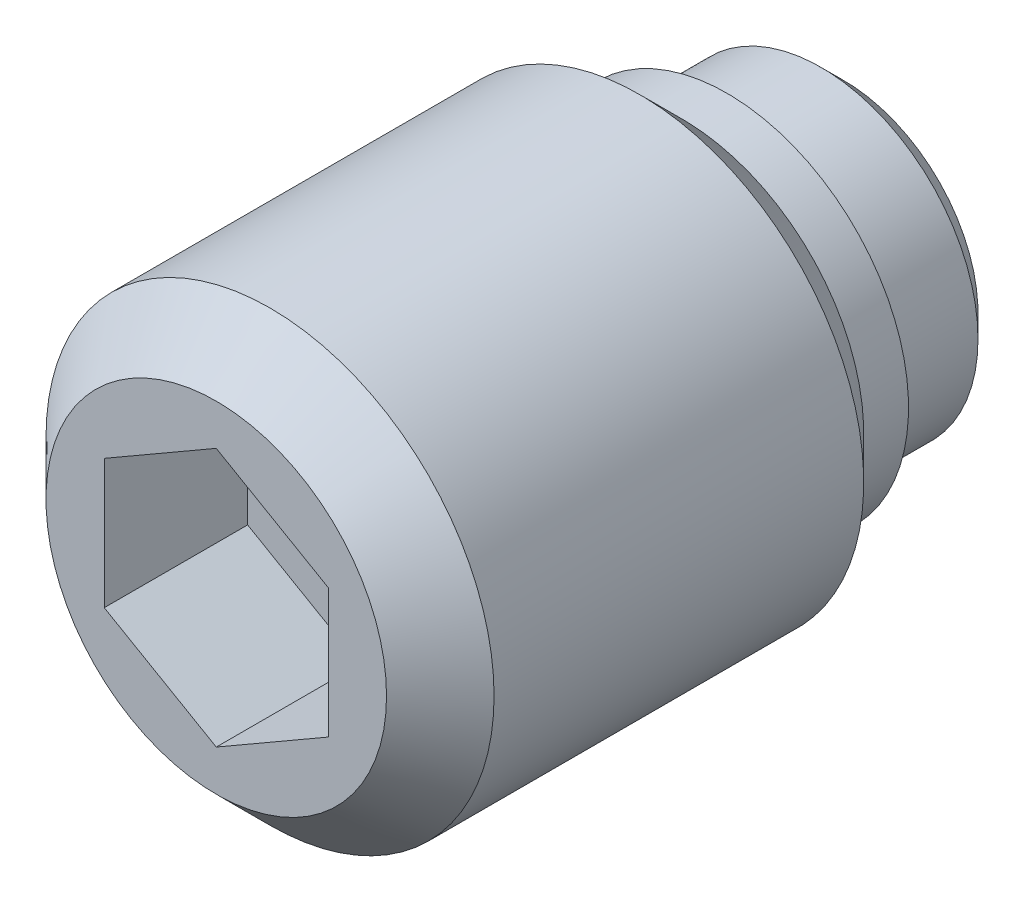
ISO-10303-21;
HEADER;
FILE_DESCRIPTION(('STEP AP214'),'2;1');
FILE_NAME('part.step','',(''),(''),'','','');
FILE_SCHEMA(('AUTOMOTIVE_DESIGN { 1 0 10303 214 1 1 1 1 }'));
ENDSEC;
DATA;
#1=APPLICATION_CONTEXT('core data for automotive mechanical design processes');
#2=APPLICATION_PROTOCOL_DEFINITION('international standard','automotive_design',2000,#1);
#3=PRODUCT_CONTEXT('',#1,'mechanical');
#4=PRODUCT('Part','Part','',(#3));
#5=PRODUCT_RELATED_PRODUCT_CATEGORY('part','',(#4));
#6=PRODUCT_DEFINITION_FORMATION('','',#4);
#7=PRODUCT_DEFINITION_CONTEXT('part definition',#1,'design');
#8=PRODUCT_DEFINITION('design','',#6,#7);
#9=PRODUCT_DEFINITION_SHAPE('','',#8);
#10=(LENGTH_UNIT() NAMED_UNIT(*) SI_UNIT(.MILLI.,.METRE.));
#11=(NAMED_UNIT(*) PLANE_ANGLE_UNIT() SI_UNIT($,.RADIAN.));
#12=(NAMED_UNIT(*) SI_UNIT($,.STERADIAN.) SOLID_ANGLE_UNIT());
#13=UNCERTAINTY_MEASURE_WITH_UNIT(LENGTH_MEASURE(1.E-05),#10,'distance_accuracy_value','');
#14=(GEOMETRIC_REPRESENTATION_CONTEXT(3) GLOBAL_UNCERTAINTY_ASSIGNED_CONTEXT((#13)) GLOBAL_UNIT_ASSIGNED_CONTEXT((#10,
#11,#12)) REPRESENTATION_CONTEXT('',''));
#15=CARTESIAN_POINT('',(0.,0.,0.));
#16=DIRECTION('',(0.,0.,1.));
#17=DIRECTION('',(1.,0.,0.));
#18=AXIS2_PLACEMENT_3D('',#15,#16,#17);
#19=CARTESIAN_POINT('',(0.,0.,2.6));
#20=DIRECTION('',(0.,0.,-1.));
#21=DIRECTION('',(-1.,0.,0.));
#22=AXIS2_PLACEMENT_3D('',#19,#20,#21);
#23=CYLINDRICAL_SURFACE('',#22,5.);
#24=CARTESIAN_POINT('',(0.,0.,4.55));
#25=DIRECTION('',(0.,0.,-1.));
#26=DIRECTION('',(-1.,0.,0.));
#27=AXIS2_PLACEMENT_3D('',#24,#25,#26);
#28=CIRCLE('',#27,5.);
#29=CARTESIAN_POINT('',(-5.,0.,4.55));
#30=VERTEX_POINT('',#29);
#31=EDGE_CURVE('E9',#30,#30,#28,.T.);
#32=ORIENTED_EDGE('',*,*,#31,.F.);
#33=EDGE_LOOP('',(#32));
#34=FACE_BOUND('',#33,.T.);
#35=CARTESIAN_POINT('',(0.,0.,12.8));
#36=DIRECTION('',(0.,0.,1.));
#37=DIRECTION('',(1.,0.,0.));
#38=AXIS2_PLACEMENT_3D('',#35,#36,#37);
#39=CIRCLE('',#38,5.);
#40=CARTESIAN_POINT('',(5.,0.,12.8));
#41=VERTEX_POINT('',#40);
#42=EDGE_CURVE('E123',#41,#41,#39,.T.);
#43=ORIENTED_EDGE('',*,*,#42,.F.);
#44=EDGE_LOOP('',(#43));
#45=FACE_BOUND('',#44,.T.);
#46=ADVANCED_FACE('F14',(#34,#45),#23,.T.);
#47=CARTESIAN_POINT('',(0.,0.,4.55));
#48=DIRECTION('',(0.,0.,1.));
#49=DIRECTION('',(1.,0.,0.));
#50=AXIS2_PLACEMENT_3D('',#47,#48,#49);
#51=CONICAL_SURFACE('',#50,5.,0.785398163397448);
#52=ORIENTED_EDGE('',*,*,#31,.T.);
#53=EDGE_LOOP('',(#52));
#54=FACE_BOUND('',#53,.T.);
#55=CARTESIAN_POINT('',(0.,0.,3.6));
#56=DIRECTION('',(0.,0.,-1.));
#57=DIRECTION('',(-1.,0.,0.));
#58=AXIS2_PLACEMENT_3D('',#55,#56,#57);
#59=CIRCLE('',#58,4.05);
#60=CARTESIAN_POINT('',(-4.05,0.,3.6));
#61=VERTEX_POINT('',#60);
#62=EDGE_CURVE('E21',#61,#61,#59,.T.);
#63=ORIENTED_EDGE('',*,*,#62,.F.);
#64=EDGE_LOOP('',(#63));
#65=FACE_BOUND('',#64,.T.);
#66=ADVANCED_FACE('F143',(#54,#65),#51,.T.);
#67=CARTESIAN_POINT('',(0.,0.,2.6));
#68=DIRECTION('',(0.,0.,-1.));
#69=DIRECTION('',(-1.,0.,0.));
#70=AXIS2_PLACEMENT_3D('',#67,#68,#69);
#71=CYLINDRICAL_SURFACE('',#70,4.05);
#72=ORIENTED_EDGE('',*,*,#62,.T.);
#73=EDGE_LOOP('',(#72));
#74=FACE_BOUND('',#73,.T.);
#75=CARTESIAN_POINT('',(0.,0.,2.6));
#76=DIRECTION('',(0.,0.,-1.));
#77=DIRECTION('',(-1.,0.,0.));
#78=AXIS2_PLACEMENT_3D('',#75,#76,#77);
#79=CIRCLE('',#78,4.05);
#80=CARTESIAN_POINT('',(-4.05,0.,2.6));
#81=VERTEX_POINT('',#80);
#82=EDGE_CURVE('E135',#81,#81,#79,.T.);
#83=ORIENTED_EDGE('',*,*,#82,.F.);
#84=EDGE_LOOP('',(#83));
#85=FACE_BOUND('',#84,.T.);
#86=ADVANCED_FACE('F140',(#74,#85),#71,.T.);
#87=CARTESIAN_POINT('',(0.,4.05,2.6));
#88=DIRECTION('',(0.,0.,1.));
#89=DIRECTION('',(1.,0.,0.));
#90=AXIS2_PLACEMENT_3D('',#87,#88,#89);
#91=PLANE('',#90);
#92=ORIENTED_EDGE('',*,*,#82,.T.);
#93=EDGE_LOOP('',(#92));
#94=FACE_BOUND('',#93,.T.);
#95=CARTESIAN_POINT('',(0.,0.,2.6));
#96=DIRECTION('',(0.,0.,-1.));
#97=DIRECTION('',(-1.,0.,0.));
#98=AXIS2_PLACEMENT_3D('',#95,#96,#97);
#99=CIRCLE('',#98,3.5);
#100=CARTESIAN_POINT('',(-3.5,0.,2.6));
#101=VERTEX_POINT('',#100);
#102=EDGE_CURVE('E132',#101,#101,#99,.T.);
#103=ORIENTED_EDGE('',*,*,#102,.F.);
#104=EDGE_LOOP('',(#103));
#105=FACE_BOUND('',#104,.T.);
#106=ADVANCED_FACE('F151',(#94,#105),#91,.F.);
#107=CARTESIAN_POINT('',(0.,0.,0.));
#108=DIRECTION('',(0.,0.,-1.));
#109=DIRECTION('',(-1.,0.,0.));
#110=AXIS2_PLACEMENT_3D('',#107,#108,#109);
#111=CYLINDRICAL_SURFACE('',#110,3.5);
#112=CARTESIAN_POINT('',(0.,0.,0.5));
#113=DIRECTION('',(0.,0.,-1.));
#114=DIRECTION('',(-1.,0.,0.));
#115=AXIS2_PLACEMENT_3D('',#112,#113,#114);
#116=CIRCLE('',#115,3.5);
#117=CARTESIAN_POINT('',(-3.5,0.,0.5));
#118=VERTEX_POINT('',#117);
#119=EDGE_CURVE('E129',#118,#118,#116,.T.);
#120=ORIENTED_EDGE('',*,*,#119,.F.);
#121=EDGE_LOOP('',(#120));
#122=FACE_BOUND('',#121,.T.);
#123=ORIENTED_EDGE('',*,*,#102,.T.);
#124=EDGE_LOOP('',(#123));
#125=FACE_BOUND('',#124,.T.);
#126=ADVANCED_FACE('F157',(#122,#125),#111,.T.);
#127=CARTESIAN_POINT('',(0.,0.,0.5));
#128=DIRECTION('',(0.,0.,1.));
#129=DIRECTION('',(1.,0.,0.));
#130=AXIS2_PLACEMENT_3D('',#127,#128,#129);
#131=CONICAL_SURFACE('',#130,3.5,0.785398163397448);
#132=CARTESIAN_POINT('',(0.,0.,0.));
#133=DIRECTION('',(0.,0.,-1.));
#134=DIRECTION('',(-1.,0.,0.));
#135=AXIS2_PLACEMENT_3D('',#132,#133,#134);
#136=CIRCLE('',#135,3.);
#137=CARTESIAN_POINT('',(-3.,0.,0.));
#138=VERTEX_POINT('',#137);
#139=EDGE_CURVE('E126',#138,#138,#136,.T.);
#140=ORIENTED_EDGE('',*,*,#139,.F.);
#141=EDGE_LOOP('',(#140));
#142=FACE_BOUND('',#141,.T.);
#143=ORIENTED_EDGE('',*,*,#119,.T.);
#144=EDGE_LOOP('',(#143));
#145=FACE_BOUND('',#144,.T.);
#146=ADVANCED_FACE('F161',(#142,#145),#131,.T.);
#147=CARTESIAN_POINT('',(0.,3.,0.));
#148=DIRECTION('',(0.,0.,1.));
#149=DIRECTION('',(1.,0.,0.));
#150=AXIS2_PLACEMENT_3D('',#147,#148,#149);
#151=PLANE('',#150);
#152=ORIENTED_EDGE('',*,*,#139,.T.);
#153=EDGE_LOOP('',(#152));
#154=FACE_BOUND('',#153,.T.);
#155=ADVANCED_FACE('F165',(#154),#151,.F.);
#156=CARTESIAN_POINT('',(0.,0.,14.));
#157=DIRECTION('',(0.,0.,-1.));
#158=DIRECTION('',(-1.,0.,0.));
#159=AXIS2_PLACEMENT_3D('',#156,#157,#158);
#160=CONICAL_SURFACE('',#159,3.8,0.785398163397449);
#161=ORIENTED_EDGE('',*,*,#42,.T.);
#162=EDGE_LOOP('',(#161));
#163=FACE_BOUND('',#162,.T.);
#164=CARTESIAN_POINT('',(0.,0.,14.));
#165=DIRECTION('',(0.,0.,1.));
#166=DIRECTION('',(1.,0.,0.));
#167=AXIS2_PLACEMENT_3D('',#164,#165,#166);
#168=CIRCLE('',#167,3.8);
#169=CARTESIAN_POINT('',(3.8,0.,14.));
#170=VERTEX_POINT('',#169);
#171=EDGE_CURVE('E115',#170,#170,#168,.T.);
#172=ORIENTED_EDGE('',*,*,#171,.F.);
#173=EDGE_LOOP('',(#172));
#174=FACE_BOUND('',#173,.T.);
#175=ADVANCED_FACE('F169',(#163,#174),#160,.T.);
#176=CARTESIAN_POINT('',(0.,-3.8,14.));
#177=DIRECTION('',(0.,0.,1.));
#178=DIRECTION('',(1.,0.,0.));
#179=AXIS2_PLACEMENT_3D('',#176,#177,#178);
#180=PLANE('',#179);
#181=DIRECTION('',(0.866025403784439,-0.5,0.));
#182=VECTOR('',#181,1.);
#183=CARTESIAN_POINT('',(-2.5,-1.44337567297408,14.));
#184=LINE('',#183,#182);
#185=CARTESIAN_POINT('',(-2.5,-1.44337567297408,14.));
#186=VERTEX_POINT('',#185);
#187=CARTESIAN_POINT('',(0.,-2.88675134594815,14.));
#188=VERTEX_POINT('',#187);
#189=EDGE_CURVE('E28',#186,#188,#184,.T.);
#190=ORIENTED_EDGE('',*,*,#189,.F.);
#191=DIRECTION('',(0.,-1.,0.));
#192=VECTOR('',#191,1.);
#193=CARTESIAN_POINT('',(-2.5,1.44337567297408,14.));
#194=LINE('',#193,#192);
#195=CARTESIAN_POINT('',(-2.5,1.44337567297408,14.));
#196=VERTEX_POINT('',#195);
#197=EDGE_CURVE('E111',#196,#186,#194,.T.);
#198=ORIENTED_EDGE('',*,*,#197,.F.);
#199=DIRECTION('',(-0.866025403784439,-0.5,0.));
#200=VECTOR('',#199,1.);
#201=CARTESIAN_POINT('',(0.,2.88675134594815,14.));
#202=LINE('',#201,#200);
#203=CARTESIAN_POINT('',(0.,2.88675134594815,14.));
#204=VERTEX_POINT('',#203);
#205=EDGE_CURVE('E109',#204,#196,#202,.T.);
#206=ORIENTED_EDGE('',*,*,#205,.F.);
#207=DIRECTION('',(-0.866025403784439,0.5,0.));
#208=VECTOR('',#207,1.);
#209=CARTESIAN_POINT('',(2.5,1.44337567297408,14.));
#210=LINE('',#209,#208);
#211=CARTESIAN_POINT('',(2.5,1.44337567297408,14.));
#212=VERTEX_POINT('',#211);
#213=EDGE_CURVE('E76',#212,#204,#210,.T.);
#214=ORIENTED_EDGE('',*,*,#213,.F.);
#215=DIRECTION('',(0.,1.,0.));
#216=VECTOR('',#215,1.);
#217=CARTESIAN_POINT('',(2.5,-1.44337567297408,14.));
#218=LINE('',#217,#216);
#219=CARTESIAN_POINT('',(2.5,-1.44337567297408,14.));
#220=VERTEX_POINT('',#219);
#221=EDGE_CURVE('E105',#220,#212,#218,.T.);
#222=ORIENTED_EDGE('',*,*,#221,.F.);
#223=DIRECTION('',(0.866025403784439,0.5,0.));
#224=VECTOR('',#223,1.);
#225=CARTESIAN_POINT('',(0.,-2.88675134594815,14.));
#226=LINE('',#225,#224);
#227=EDGE_CURVE('E102',#188,#220,#226,.T.);
#228=ORIENTED_EDGE('',*,*,#227,.F.);
#229=EDGE_LOOP('',(#190,#198,#206,#214,#222,#228));
#230=FACE_BOUND('',#229,.T.);
#231=ORIENTED_EDGE('',*,*,#171,.T.);
#232=EDGE_LOOP('',(#231));
#233=FACE_BOUND('',#232,.T.);
#234=ADVANCED_FACE('F173',(#230,#233),#180,.T.);
#235=CARTESIAN_POINT('',(-2.5,-1.44337567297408,10.8));
#236=DIRECTION('',(-0.5,-0.866025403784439,0.));
#237=DIRECTION('',(0.866025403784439,-0.5,0.));
#238=AXIS2_PLACEMENT_3D('',#235,#236,#237);
#239=PLANE('',#238);
#240=ORIENTED_EDGE('',*,*,#189,.T.);
#241=DIRECTION('',(0.,0.,1.));
#242=VECTOR('',#241,1.);
#243=CARTESIAN_POINT('',(0.,-2.88675134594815,10.8));
#244=LINE('',#243,#242);
#245=CARTESIAN_POINT('',(0.,-2.88675134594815,10.8));
#246=VERTEX_POINT('',#245);
#247=EDGE_CURVE('E58',#246,#188,#244,.T.);
#248=ORIENTED_EDGE('',*,*,#247,.F.);
#249=DIRECTION('',(0.866025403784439,-0.5,0.));
#250=VECTOR('',#249,1.);
#251=CARTESIAN_POINT('',(-2.5,-1.44337567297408,10.8));
#252=LINE('',#251,#250);
#253=CARTESIAN_POINT('',(-2.5,-1.44337567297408,10.8));
#254=VERTEX_POINT('',#253);
#255=EDGE_CURVE('E113',#254,#246,#252,.T.);
#256=ORIENTED_EDGE('',*,*,#255,.F.);
#257=DIRECTION('',(0.,0.,1.));
#258=VECTOR('',#257,1.);
#259=CARTESIAN_POINT('',(-2.5,-1.44337567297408,10.8));
#260=LINE('',#259,#258);
#261=EDGE_CURVE('E36',#254,#186,#260,.T.);
#262=ORIENTED_EDGE('',*,*,#261,.T.);
#263=EDGE_LOOP('',(#240,#248,#256,#262));
#264=FACE_BOUND('',#263,.T.);
#265=ADVANCED_FACE('F177',(#264),#239,.F.);
#266=CARTESIAN_POINT('',(-2.5,1.44337567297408,10.8));
#267=DIRECTION('',(-1.,0.,0.));
#268=DIRECTION('',(0.,0.,1.));
#269=AXIS2_PLACEMENT_3D('',#266,#267,#268);
#270=PLANE('',#269);
#271=ORIENTED_EDGE('',*,*,#197,.T.);
#272=ORIENTED_EDGE('',*,*,#261,.F.);
#273=DIRECTION('',(0.,-1.,0.));
#274=VECTOR('',#273,1.);
#275=CARTESIAN_POINT('',(-2.5,1.44337567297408,10.8));
#276=LINE('',#275,#274);
#277=CARTESIAN_POINT('',(-2.5,1.44337567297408,10.8));
#278=VERTEX_POINT('',#277);
#279=EDGE_CURVE('E88',#278,#254,#276,.T.);
#280=ORIENTED_EDGE('',*,*,#279,.F.);
#281=DIRECTION('',(0.,0.,1.));
#282=VECTOR('',#281,1.);
#283=CARTESIAN_POINT('',(-2.5,1.44337567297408,10.8));
#284=LINE('',#283,#282);
#285=EDGE_CURVE('E80',#278,#196,#284,.T.);
#286=ORIENTED_EDGE('',*,*,#285,.T.);
#287=EDGE_LOOP('',(#271,#272,#280,#286));
#288=FACE_BOUND('',#287,.T.);
#289=ADVANCED_FACE('F181',(#288),#270,.F.);
#290=CARTESIAN_POINT('',(0.,2.88675134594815,10.8));
#291=DIRECTION('',(-0.5,0.866025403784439,0.));
#292=DIRECTION('',(-0.866025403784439,-0.5,0.));
#293=AXIS2_PLACEMENT_3D('',#290,#291,#292);
#294=PLANE('',#293);
#295=ORIENTED_EDGE('',*,*,#205,.T.);
#296=ORIENTED_EDGE('',*,*,#285,.F.);
#297=DIRECTION('',(-0.866025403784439,-0.5,0.));
#298=VECTOR('',#297,1.);
#299=CARTESIAN_POINT('',(0.,2.88675134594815,10.8));
#300=LINE('',#299,#298);
#301=CARTESIAN_POINT('',(0.,2.88675134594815,10.8));
#302=VERTEX_POINT('',#301);
#303=EDGE_CURVE('E84',#302,#278,#300,.T.);
#304=ORIENTED_EDGE('',*,*,#303,.F.);
#305=DIRECTION('',(0.,0.,1.));
#306=VECTOR('',#305,1.);
#307=CARTESIAN_POINT('',(0.,2.88675134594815,10.8));
#308=LINE('',#307,#306);
#309=EDGE_CURVE('E69',#302,#204,#308,.T.);
#310=ORIENTED_EDGE('',*,*,#309,.T.);
#311=EDGE_LOOP('',(#295,#296,#304,#310));
#312=FACE_BOUND('',#311,.T.);
#313=ADVANCED_FACE('F85',(#312),#294,.F.);
#314=CARTESIAN_POINT('',(2.5,1.44337567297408,10.8));
#315=DIRECTION('',(0.5,0.866025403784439,0.));
#316=DIRECTION('',(-0.866025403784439,0.5,0.));
#317=AXIS2_PLACEMENT_3D('',#314,#315,#316);
#318=PLANE('',#317);
#319=ORIENTED_EDGE('',*,*,#213,.T.);
#320=ORIENTED_EDGE('',*,*,#309,.F.);
#321=DIRECTION('',(-0.866025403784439,0.5,0.));
#322=VECTOR('',#321,1.);
#323=CARTESIAN_POINT('',(2.5,1.44337567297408,10.8));
#324=LINE('',#323,#322);
#325=CARTESIAN_POINT('',(2.5,1.44337567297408,10.8));
#326=VERTEX_POINT('',#325);
#327=EDGE_CURVE('E73',#326,#302,#324,.T.);
#328=ORIENTED_EDGE('',*,*,#327,.F.);
#329=DIRECTION('',(0.,0.,1.));
#330=VECTOR('',#329,1.);
#331=CARTESIAN_POINT('',(2.5,1.44337567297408,10.8));
#332=LINE('',#331,#330);
#333=EDGE_CURVE('E81',#326,#212,#332,.T.);
#334=ORIENTED_EDGE('',*,*,#333,.T.);
#335=EDGE_LOOP('',(#319,#320,#328,#334));
#336=FACE_BOUND('',#335,.T.);
#337=ADVANCED_FACE('F71',(#336),#318,.F.);
#338=CARTESIAN_POINT('',(2.5,-1.44337567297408,10.8));
#339=DIRECTION('',(1.,0.,0.));
#340=DIRECTION('',(0.,0.,-1.));
#341=AXIS2_PLACEMENT_3D('',#338,#339,#340);
#342=PLANE('',#341);
#343=ORIENTED_EDGE('',*,*,#221,.T.);
#344=ORIENTED_EDGE('',*,*,#333,.F.);
#345=DIRECTION('',(0.,1.,0.));
#346=VECTOR('',#345,1.);
#347=CARTESIAN_POINT('',(2.5,-1.44337567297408,10.8));
#348=LINE('',#347,#346);
#349=CARTESIAN_POINT('',(2.5,-1.44337567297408,10.8));
#350=VERTEX_POINT('',#349);
#351=EDGE_CURVE('E94',#350,#326,#348,.T.);
#352=ORIENTED_EDGE('',*,*,#351,.F.);
#353=DIRECTION('',(0.,0.,1.));
#354=VECTOR('',#353,1.);
#355=CARTESIAN_POINT('',(2.5,-1.44337567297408,10.8));
#356=LINE('',#355,#354);
#357=EDGE_CURVE('E118',#350,#220,#356,.T.);
#358=ORIENTED_EDGE('',*,*,#357,.T.);
#359=EDGE_LOOP('',(#343,#344,#352,#358));
#360=FACE_BOUND('',#359,.T.);
#361=ADVANCED_FACE('F185',(#360),#342,.F.);
#362=CARTESIAN_POINT('',(0.,-2.88675134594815,10.8));
#363=DIRECTION('',(0.5,-0.866025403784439,0.));
#364=DIRECTION('',(0.866025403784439,0.5,0.));
#365=AXIS2_PLACEMENT_3D('',#362,#363,#364);
#366=PLANE('',#365);
#367=ORIENTED_EDGE('',*,*,#227,.T.);
#368=ORIENTED_EDGE('',*,*,#357,.F.);
#369=DIRECTION('',(0.866025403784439,0.5,0.));
#370=VECTOR('',#369,1.);
#371=CARTESIAN_POINT('',(0.,-2.88675134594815,10.8));
#372=LINE('',#371,#370);
#373=EDGE_CURVE('E96',#246,#350,#372,.T.);
#374=ORIENTED_EDGE('',*,*,#373,.F.);
#375=ORIENTED_EDGE('',*,*,#247,.T.);
#376=EDGE_LOOP('',(#367,#368,#374,#375));
#377=FACE_BOUND('',#376,.T.);
#378=ADVANCED_FACE('F182',(#377),#366,.F.);
#379=CARTESIAN_POINT('',(0.,0.,10.8));
#380=DIRECTION('',(0.,0.,1.));
#381=DIRECTION('',(1.,0.,0.));
#382=AXIS2_PLACEMENT_3D('',#379,#380,#381);
#383=PLANE('',#382);
#384=ORIENTED_EDGE('',*,*,#255,.T.);
#385=ORIENTED_EDGE('',*,*,#373,.T.);
#386=ORIENTED_EDGE('',*,*,#351,.T.);
#387=ORIENTED_EDGE('',*,*,#327,.T.);
#388=ORIENTED_EDGE('',*,*,#303,.T.);
#389=ORIENTED_EDGE('',*,*,#279,.T.);
#390=EDGE_LOOP('',(#384,#385,#386,#387,#388,#389));
#391=FACE_BOUND('',#390,.T.);
#392=ADVANCED_FACE('F91',(#391),#383,.T.);
#393=CLOSED_SHELL('',(#46,#66,#86,#106,#126,#146,#155,#175,#234,#265,#289,#313,#337,#361,#378,#392));
#394=MANIFOLD_SOLID_BREP('B1',#393);
#395=ADVANCED_BREP_SHAPE_REPRESENTATION('',(#18,#394),#14);
#396=SHAPE_DEFINITION_REPRESENTATION(#9,#395);
ENDSEC;
END-ISO-10303-21;
